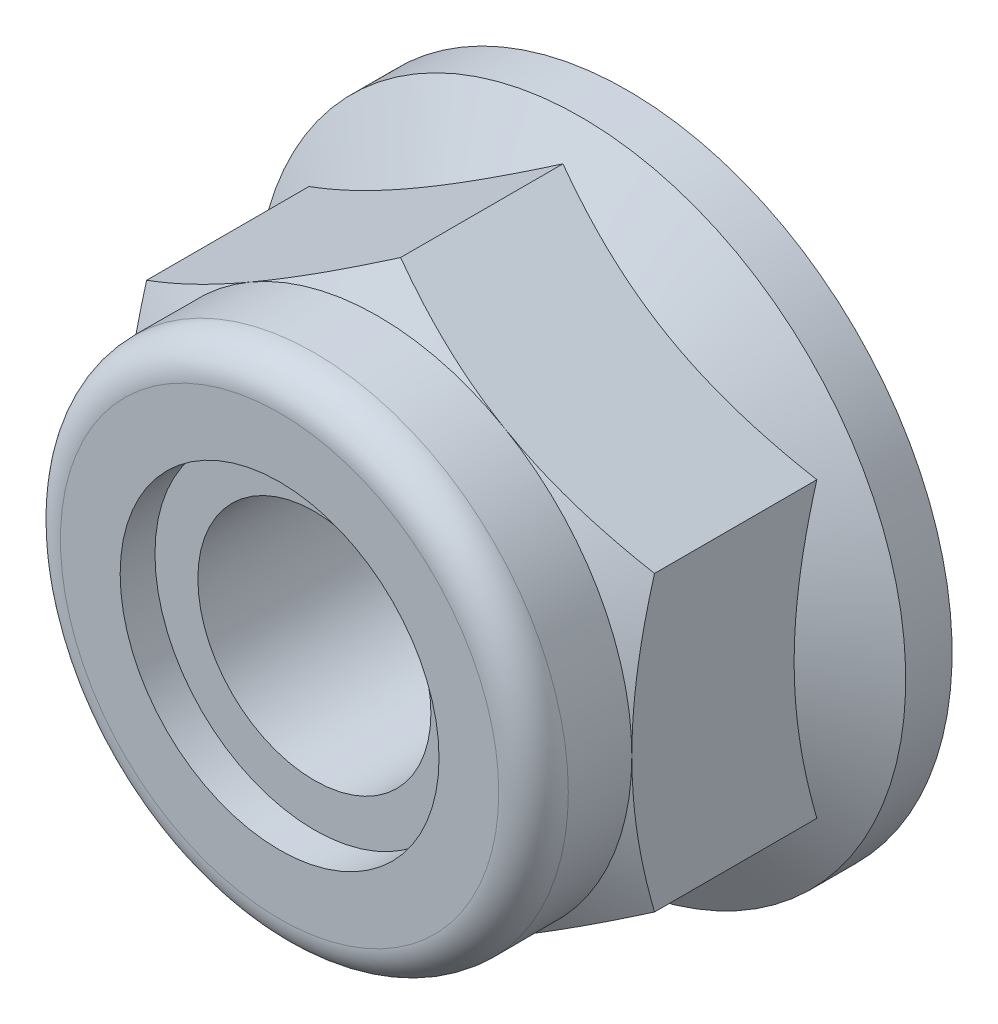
from build123d import *

# Parameters (mm, degrees)
HEX_START   = 5.466546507
HEXSKE_R    = 2.5527
HEX_2_DEPTH = 5.466546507


with BuildPart() as part:
    # BaseNutSke → BaseNut (revolve)
    with BuildSketch(Plane(origin=(0, 0, 0), x_dir=(0, 0, -1), z_dir=(1, 0, 0)), mode=Mode.PRIVATE) as basenut_sk:
        Polygon((-5.466546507, 2.5527), (-5.466546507, 5.5626), (-1.910546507, 5.5626), (-1.016, 7.112), (0, 7.112), (0, 2.5527), align=None)
    revolve(basenut_sk.sketch.rotate(Axis((0, 0, 0), (0, 0, 1)), 90), axis=Axis((0, 0, 0), (0, 0, 1)))

    # HexSke → Hex 2 (add)
    with BuildSketch(Plane.XY.offset(HEX_START)):
        Polygon((5.5626, -3.211568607), (5.5626, 3.211568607), (0, 6.423137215), (-5.5626, 3.211568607), (-5.5626, -3.211568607), (0, -6.423137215), align=None)
        with Locations(Location((0, 0, 0), (0, 0, 180))):
            Circle(HEXSKE_R, mode=Mode.SUBTRACT)
    extrude(amount=-HEX_2_DEPTH)

    # TorqEleSke → TorqueElement (revolve)
    with BuildSketch(Plane(origin=(0, 0, 0), x_dir=(1, 0, 0), z_dir=(0, 1, 0))):
        with BuildLine():
            Line((5.5626, -5.466546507), (5.5626, -6.858))
            ThreePointArc((5.5626, -6.858), (5.339415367, -7.396815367), (4.8006, -7.62))
            Line((4.8006, -7.62), (3.4925, -7.62))
            Line((3.4925, -7.62), (3.4925, -6.858))
            Line((3.4925, -6.858), (2.5527, -6.858))
            Line((2.5527, -6.858), (2.5527, -5.466546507))
            Line((2.5527, -5.466546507), (5.5626, -5.466546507))
        make_face()
    revolve(axis=Axis((0, 0, 1000), (0, 0, -1)))

    # FilletSke → HexFillet (revolve, cut)
    with BuildSketch(Plane(origin=(0, 0, 0), x_dir=(0, 0, -1), z_dir=(1, 0, 0)), mode=Mode.PRIVATE) as hexfillet_sk:
        Polygon((-5.466546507, 5.5626), (-4.969715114, 6.423137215), (-5.466546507, 6.423137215), align=None)
    revolve(hexfillet_sk.sketch.rotate(Axis((0, 0, 0), (0, 0, -1)), 270), axis=Axis((0, 0, 0), (0, 0, -1)), mode=Mode.SUBTRACT)

    # ThdSchSke → ThreadSchematic (revolve, cut)
    with BuildSketch(Plane(origin=(0, 0, 0), x_dir=(0, 0, -1), z_dir=(1, 0, 0)), mode=Mode.PRIVATE) as threadschematic_sk:
        Polygon((-0.359285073, 2.5527), (0, 3.175), (0.359285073, 2.5527), align=None)
    revolve(threadschematic_sk.sketch.rotate(Axis((0, 0, 0), (0, 0, 1)), 90), axis=Axis((0, 0, 0), (0, 0, 1)), mode=Mode.SUBTRACT)


solid = part.part
